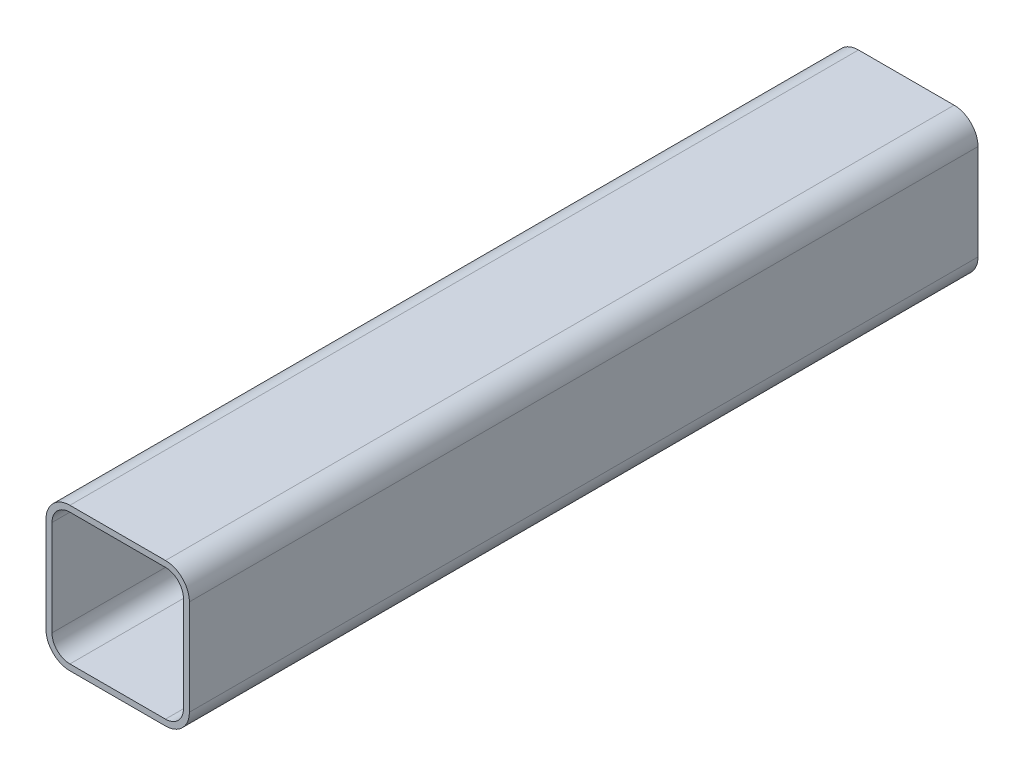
ISO-10303-21;
HEADER;
FILE_DESCRIPTION(('STEP AP214'),'2;1');
FILE_NAME('part.step','',(''),(''),'','','');
FILE_SCHEMA(('AUTOMOTIVE_DESIGN { 1 0 10303 214 1 1 1 1 }'));
ENDSEC;
DATA;
#1=APPLICATION_CONTEXT('core data for automotive mechanical design processes');
#2=APPLICATION_PROTOCOL_DEFINITION('international standard','automotive_design',2000,#1);
#3=PRODUCT_CONTEXT('',#1,'mechanical');
#4=PRODUCT('Part','Part','',(#3));
#5=PRODUCT_RELATED_PRODUCT_CATEGORY('part','',(#4));
#6=PRODUCT_DEFINITION_FORMATION('','',#4);
#7=PRODUCT_DEFINITION_CONTEXT('part definition',#1,'design');
#8=PRODUCT_DEFINITION('design','',#6,#7);
#9=PRODUCT_DEFINITION_SHAPE('','',#8);
#10=(LENGTH_UNIT() NAMED_UNIT(*) SI_UNIT(.MILLI.,.METRE.));
#11=(NAMED_UNIT(*) PLANE_ANGLE_UNIT() SI_UNIT($,.RADIAN.));
#12=(NAMED_UNIT(*) SI_UNIT($,.STERADIAN.) SOLID_ANGLE_UNIT());
#13=UNCERTAINTY_MEASURE_WITH_UNIT(LENGTH_MEASURE(1.E-05),#10,'distance_accuracy_value','');
#14=(GEOMETRIC_REPRESENTATION_CONTEXT(3) GLOBAL_UNCERTAINTY_ASSIGNED_CONTEXT((#13)) GLOBAL_UNIT_ASSIGNED_CONTEXT((#10,
#11,#12)) REPRESENTATION_CONTEXT('',''));
#15=CARTESIAN_POINT('',(0.,0.,0.));
#16=DIRECTION('',(0.,0.,1.));
#17=DIRECTION('',(1.,0.,0.));
#18=AXIS2_PLACEMENT_3D('',#15,#16,#17);
#19=CARTESIAN_POINT('',(25.4,25.4,419.1));
#20=DIRECTION('',(0.,0.,1.));
#21=DIRECTION('',(1.,0.,0.));
#22=AXIS2_PLACEMENT_3D('',#19,#20,#21);
#23=PLANE('',#22);
#24=CARTESIAN_POINT('',(25.4,25.4,419.1));
#25=DIRECTION('',(0.,0.,1.));
#26=DIRECTION('',(1.,0.,0.));
#27=AXIS2_PLACEMENT_3D('',#24,#25,#26);
#28=CIRCLE('',#27,12.7);
#29=CARTESIAN_POINT('',(38.1,25.4,419.1));
#30=VERTEX_POINT('',#29);
#31=CARTESIAN_POINT('',(25.4,38.1,419.1));
#32=VERTEX_POINT('',#31);
#33=EDGE_CURVE('E212',#30,#32,#28,.T.);
#34=ORIENTED_EDGE('',*,*,#33,.T.);
#35=DIRECTION('',(1.,0.,0.));
#36=VECTOR('',#35,1.);
#37=CARTESIAN_POINT('',(-25.4,38.1,419.1));
#38=LINE('',#37,#36);
#39=CARTESIAN_POINT('',(-25.4,38.1,419.1));
#40=VERTEX_POINT('',#39);
#41=EDGE_CURVE('E214',#40,#32,#38,.T.);
#42=ORIENTED_EDGE('',*,*,#41,.F.);
#43=CARTESIAN_POINT('',(-25.4,25.4,419.1));
#44=DIRECTION('',(0.,0.,-1.));
#45=DIRECTION('',(-1.,0.,0.));
#46=AXIS2_PLACEMENT_3D('',#43,#44,#45);
#47=CIRCLE('',#46,12.7);
#48=CARTESIAN_POINT('',(-38.1,25.4,419.1));
#49=VERTEX_POINT('',#48);
#50=EDGE_CURVE('E218',#49,#40,#47,.T.);
#51=ORIENTED_EDGE('',*,*,#50,.F.);
#52=DIRECTION('',(0.,-1.,0.));
#53=VECTOR('',#52,1.);
#54=CARTESIAN_POINT('',(-38.1,25.4,419.1));
#55=LINE('',#54,#53);
#56=CARTESIAN_POINT('',(-38.1,-25.4,419.1));
#57=VERTEX_POINT('',#56);
#58=EDGE_CURVE('E221',#49,#57,#55,.T.);
#59=ORIENTED_EDGE('',*,*,#58,.T.);
#60=CARTESIAN_POINT('',(-25.4,-25.4,419.1));
#61=DIRECTION('',(0.,0.,-1.));
#62=DIRECTION('',(-1.,0.,0.));
#63=AXIS2_PLACEMENT_3D('',#60,#61,#62);
#64=CIRCLE('',#63,12.7);
#65=CARTESIAN_POINT('',(-25.4,-38.1,419.1));
#66=VERTEX_POINT('',#65);
#67=EDGE_CURVE('E223',#66,#57,#64,.T.);
#68=ORIENTED_EDGE('',*,*,#67,.F.);
#69=DIRECTION('',(-1.,0.,0.));
#70=VECTOR('',#69,1.);
#71=CARTESIAN_POINT('',(25.4,-38.1,419.1));
#72=LINE('',#71,#70);
#73=CARTESIAN_POINT('',(25.4,-38.1,419.1));
#74=VERTEX_POINT('',#73);
#75=EDGE_CURVE('E226',#74,#66,#72,.T.);
#76=ORIENTED_EDGE('',*,*,#75,.F.);
#77=CARTESIAN_POINT('',(25.4,-25.4,419.1));
#78=DIRECTION('',(0.,0.,-1.));
#79=DIRECTION('',(-1.,0.,0.));
#80=AXIS2_PLACEMENT_3D('',#77,#78,#79);
#81=CIRCLE('',#80,12.7);
#82=CARTESIAN_POINT('',(38.1,-25.4000000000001,419.1));
#83=VERTEX_POINT('',#82);
#84=EDGE_CURVE('E229',#83,#74,#81,.T.);
#85=ORIENTED_EDGE('',*,*,#84,.F.);
#86=DIRECTION('',(0.,1.,0.));
#87=VECTOR('',#86,1.);
#88=CARTESIAN_POINT('',(38.1,-25.4000000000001,419.1));
#89=LINE('',#88,#87);
#90=EDGE_CURVE('E232',#83,#30,#89,.T.);
#91=ORIENTED_EDGE('',*,*,#90,.T.);
#92=EDGE_LOOP('',(#34,#42,#51,#59,#68,#76,#85,#91));
#93=FACE_BOUND('',#92,.T.);
#94=DIRECTION('',(1.,0.,0.));
#95=VECTOR('',#94,1.);
#96=CARTESIAN_POINT('',(-25.4,34.925,419.1));
#97=LINE('',#96,#95);
#98=CARTESIAN_POINT('',(-25.4,34.925,419.1));
#99=VERTEX_POINT('',#98);
#100=CARTESIAN_POINT('',(25.4,34.925,419.1));
#101=VERTEX_POINT('',#100);
#102=EDGE_CURVE('E152',#99,#101,#97,.T.);
#103=ORIENTED_EDGE('',*,*,#102,.T.);
#104=CARTESIAN_POINT('',(25.4,25.4,419.1));
#105=DIRECTION('',(0.,0.,1.));
#106=DIRECTION('',(1.,0.,0.));
#107=AXIS2_PLACEMENT_3D('',#104,#105,#106);
#108=CIRCLE('',#107,9.525);
#109=CARTESIAN_POINT('',(34.925,25.4,419.1));
#110=VERTEX_POINT('',#109);
#111=EDGE_CURVE('E143',#110,#101,#108,.T.);
#112=ORIENTED_EDGE('',*,*,#111,.F.);
#113=DIRECTION('',(0.,1.,0.));
#114=VECTOR('',#113,1.);
#115=CARTESIAN_POINT('',(34.925,-25.4000000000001,419.1));
#116=LINE('',#115,#114);
#117=CARTESIAN_POINT('',(34.925,-25.4000000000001,419.1));
#118=VERTEX_POINT('',#117);
#119=EDGE_CURVE('E179',#118,#110,#116,.T.);
#120=ORIENTED_EDGE('',*,*,#119,.F.);
#121=CARTESIAN_POINT('',(25.4,-25.4,419.1));
#122=DIRECTION('',(0.,0.,1.));
#123=DIRECTION('',(1.,0.,0.));
#124=AXIS2_PLACEMENT_3D('',#121,#122,#123);
#125=CIRCLE('',#124,9.525);
#126=CARTESIAN_POINT('',(25.4,-34.925,419.1));
#127=VERTEX_POINT('',#126);
#128=EDGE_CURVE('E47',#118,#127,#125,.F.);
#129=ORIENTED_EDGE('',*,*,#128,.T.);
#130=DIRECTION('',(-1.,0.,0.));
#131=VECTOR('',#130,1.);
#132=CARTESIAN_POINT('',(25.4,-34.925,419.1));
#133=LINE('',#132,#131);
#134=CARTESIAN_POINT('',(-25.4,-34.925,419.1));
#135=VERTEX_POINT('',#134);
#136=EDGE_CURVE('E175',#127,#135,#133,.T.);
#137=ORIENTED_EDGE('',*,*,#136,.T.);
#138=CARTESIAN_POINT('',(-25.4,-25.4,419.1));
#139=DIRECTION('',(0.,0.,1.));
#140=DIRECTION('',(1.,0.,0.));
#141=AXIS2_PLACEMENT_3D('',#138,#139,#140);
#142=CIRCLE('',#141,9.52499999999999);
#143=CARTESIAN_POINT('',(-34.925,-25.4,419.1));
#144=VERTEX_POINT('',#143);
#145=EDGE_CURVE('E172',#135,#144,#142,.F.);
#146=ORIENTED_EDGE('',*,*,#145,.T.);
#147=DIRECTION('',(0.,-1.,0.));
#148=VECTOR('',#147,1.);
#149=CARTESIAN_POINT('',(-34.925,25.4,419.1));
#150=LINE('',#149,#148);
#151=CARTESIAN_POINT('',(-34.925,25.4,419.1));
#152=VERTEX_POINT('',#151);
#153=EDGE_CURVE('E168',#152,#144,#150,.T.);
#154=ORIENTED_EDGE('',*,*,#153,.F.);
#155=CARTESIAN_POINT('',(-25.4,25.4,419.1));
#156=DIRECTION('',(0.,0.,1.));
#157=DIRECTION('',(1.,0.,0.));
#158=AXIS2_PLACEMENT_3D('',#155,#156,#157);
#159=CIRCLE('',#158,9.525);
#160=EDGE_CURVE('E166',#152,#99,#159,.F.);
#161=ORIENTED_EDGE('',*,*,#160,.T.);
#162=EDGE_LOOP('',(#103,#112,#120,#129,#137,#146,#154,#161));
#163=FACE_BOUND('',#162,.T.);
#164=ADVANCED_FACE('F32',(#93,#163),#23,.T.);
#165=CARTESIAN_POINT('',(25.4,25.4,0.));
#166=DIRECTION('',(0.,0.,1.));
#167=DIRECTION('',(1.,0.,0.));
#168=AXIS2_PLACEMENT_3D('',#165,#166,#167);
#169=PLANE('',#168);
#170=CARTESIAN_POINT('',(25.4,25.4,0.));
#171=DIRECTION('',(0.,0.,1.));
#172=DIRECTION('',(1.,0.,0.));
#173=AXIS2_PLACEMENT_3D('',#170,#171,#172);
#174=CIRCLE('',#173,12.7);
#175=CARTESIAN_POINT('',(38.1,25.4,0.));
#176=VERTEX_POINT('',#175);
#177=CARTESIAN_POINT('',(25.4,38.1,0.));
#178=VERTEX_POINT('',#177);
#179=EDGE_CURVE('E161',#176,#178,#174,.T.);
#180=ORIENTED_EDGE('',*,*,#179,.F.);
#181=DIRECTION('',(0.,1.,0.));
#182=VECTOR('',#181,1.);
#183=CARTESIAN_POINT('',(38.1,-25.4000000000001,0.));
#184=LINE('',#183,#182);
#185=CARTESIAN_POINT('',(38.1,-25.4000000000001,0.));
#186=VERTEX_POINT('',#185);
#187=EDGE_CURVE('E215',#186,#176,#184,.T.);
#188=ORIENTED_EDGE('',*,*,#187,.F.);
#189=CARTESIAN_POINT('',(25.4,-25.4,0.));
#190=DIRECTION('',(0.,0.,-1.));
#191=DIRECTION('',(-1.,0.,0.));
#192=AXIS2_PLACEMENT_3D('',#189,#190,#191);
#193=CIRCLE('',#192,12.7);
#194=CARTESIAN_POINT('',(25.4,-38.1,0.));
#195=VERTEX_POINT('',#194);
#196=EDGE_CURVE('E252',#186,#195,#193,.T.);
#197=ORIENTED_EDGE('',*,*,#196,.T.);
#198=DIRECTION('',(-1.,0.,0.));
#199=VECTOR('',#198,1.);
#200=CARTESIAN_POINT('',(25.4,-38.1,0.));
#201=LINE('',#200,#199);
#202=CARTESIAN_POINT('',(-25.4,-38.1,0.));
#203=VERTEX_POINT('',#202);
#204=EDGE_CURVE('E249',#195,#203,#201,.T.);
#205=ORIENTED_EDGE('',*,*,#204,.T.);
#206=CARTESIAN_POINT('',(-25.4,-25.4,0.));
#207=DIRECTION('',(0.,0.,-1.));
#208=DIRECTION('',(-1.,0.,0.));
#209=AXIS2_PLACEMENT_3D('',#206,#207,#208);
#210=CIRCLE('',#209,12.7);
#211=CARTESIAN_POINT('',(-38.1,-25.4,0.));
#212=VERTEX_POINT('',#211);
#213=EDGE_CURVE('E246',#203,#212,#210,.T.);
#214=ORIENTED_EDGE('',*,*,#213,.T.);
#215=DIRECTION('',(0.,-1.,0.));
#216=VECTOR('',#215,1.);
#217=CARTESIAN_POINT('',(-38.1,25.4,0.));
#218=LINE('',#217,#216);
#219=CARTESIAN_POINT('',(-38.1,25.4,0.));
#220=VERTEX_POINT('',#219);
#221=EDGE_CURVE('E243',#220,#212,#218,.T.);
#222=ORIENTED_EDGE('',*,*,#221,.F.);
#223=CARTESIAN_POINT('',(-25.4,25.4,0.));
#224=DIRECTION('',(0.,0.,-1.));
#225=DIRECTION('',(-1.,0.,0.));
#226=AXIS2_PLACEMENT_3D('',#223,#224,#225);
#227=CIRCLE('',#226,12.7);
#228=CARTESIAN_POINT('',(-25.4,38.1,0.));
#229=VERTEX_POINT('',#228);
#230=EDGE_CURVE('E240',#220,#229,#227,.T.);
#231=ORIENTED_EDGE('',*,*,#230,.T.);
#232=DIRECTION('',(1.,0.,0.));
#233=VECTOR('',#232,1.);
#234=CARTESIAN_POINT('',(-25.4,38.1,0.));
#235=LINE('',#234,#233);
#236=EDGE_CURVE('E237',#229,#178,#235,.T.);
#237=ORIENTED_EDGE('',*,*,#236,.T.);
#238=EDGE_LOOP('',(#180,#188,#197,#205,#214,#222,#231,#237));
#239=FACE_BOUND('',#238,.T.);
#240=CARTESIAN_POINT('',(25.4,25.4,0.));
#241=DIRECTION('',(0.,0.,1.));
#242=DIRECTION('',(1.,0.,0.));
#243=AXIS2_PLACEMENT_3D('',#240,#241,#242);
#244=CIRCLE('',#243,9.525);
#245=CARTESIAN_POINT('',(34.925,25.4,0.));
#246=VERTEX_POINT('',#245);
#247=CARTESIAN_POINT('',(25.4,34.925,0.));
#248=VERTEX_POINT('',#247);
#249=EDGE_CURVE('E55',#246,#248,#244,.T.);
#250=ORIENTED_EDGE('',*,*,#249,.T.);
#251=DIRECTION('',(1.,0.,0.));
#252=VECTOR('',#251,1.);
#253=CARTESIAN_POINT('',(-25.4,34.925,0.));
#254=LINE('',#253,#252);
#255=CARTESIAN_POINT('',(-25.4,34.925,0.));
#256=VERTEX_POINT('',#255);
#257=EDGE_CURVE('E160',#256,#248,#254,.T.);
#258=ORIENTED_EDGE('',*,*,#257,.F.);
#259=CARTESIAN_POINT('',(-25.4,25.4,0.));
#260=DIRECTION('',(0.,0.,1.));
#261=DIRECTION('',(1.,0.,0.));
#262=AXIS2_PLACEMENT_3D('',#259,#260,#261);
#263=CIRCLE('',#262,9.525);
#264=CARTESIAN_POINT('',(-34.925,25.4,0.));
#265=VERTEX_POINT('',#264);
#266=EDGE_CURVE('E183',#265,#256,#263,.F.);
#267=ORIENTED_EDGE('',*,*,#266,.F.);
#268=DIRECTION('',(0.,-1.,0.));
#269=VECTOR('',#268,1.);
#270=CARTESIAN_POINT('',(-34.925,25.4,0.));
#271=LINE('',#270,#269);
#272=CARTESIAN_POINT('',(-34.925,-25.4,0.));
#273=VERTEX_POINT('',#272);
#274=EDGE_CURVE('E186',#265,#273,#271,.T.);
#275=ORIENTED_EDGE('',*,*,#274,.T.);
#276=CARTESIAN_POINT('',(-25.4,-25.4,0.));
#277=DIRECTION('',(0.,0.,1.));
#278=DIRECTION('',(1.,0.,0.));
#279=AXIS2_PLACEMENT_3D('',#276,#277,#278);
#280=CIRCLE('',#279,9.52499999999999);
#281=CARTESIAN_POINT('',(-25.4,-34.925,0.));
#282=VERTEX_POINT('',#281);
#283=EDGE_CURVE('E189',#282,#273,#280,.F.);
#284=ORIENTED_EDGE('',*,*,#283,.F.);
#285=DIRECTION('',(-1.,0.,0.));
#286=VECTOR('',#285,1.);
#287=CARTESIAN_POINT('',(25.4,-34.925,0.));
#288=LINE('',#287,#286);
#289=CARTESIAN_POINT('',(25.4,-34.925,0.));
#290=VERTEX_POINT('',#289);
#291=EDGE_CURVE('E192',#290,#282,#288,.T.);
#292=ORIENTED_EDGE('',*,*,#291,.F.);
#293=CARTESIAN_POINT('',(25.4,-25.4,0.));
#294=DIRECTION('',(0.,0.,1.));
#295=DIRECTION('',(1.,0.,0.));
#296=AXIS2_PLACEMENT_3D('',#293,#294,#295);
#297=CIRCLE('',#296,9.525);
#298=CARTESIAN_POINT('',(34.925,-25.4000000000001,0.));
#299=VERTEX_POINT('',#298);
#300=EDGE_CURVE('E195',#299,#290,#297,.F.);
#301=ORIENTED_EDGE('',*,*,#300,.F.);
#302=DIRECTION('',(0.,1.,0.));
#303=VECTOR('',#302,1.);
#304=CARTESIAN_POINT('',(34.925,-25.4000000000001,0.));
#305=LINE('',#304,#303);
#306=EDGE_CURVE('E153',#299,#246,#305,.T.);
#307=ORIENTED_EDGE('',*,*,#306,.T.);
#308=EDGE_LOOP('',(#250,#258,#267,#275,#284,#292,#301,#307));
#309=FACE_BOUND('',#308,.T.);
#310=ADVANCED_FACE('F279',(#239,#309),#169,.F.);
#311=CARTESIAN_POINT('',(25.4,25.4,419.1));
#312=DIRECTION('',(0.,0.,-1.));
#313=DIRECTION('',(-1.,0.,0.));
#314=AXIS2_PLACEMENT_3D('',#311,#312,#313);
#315=CYLINDRICAL_SURFACE('',#314,12.7);
#316=ORIENTED_EDGE('',*,*,#179,.T.);
#317=DIRECTION('',(0.,0.,-1.));
#318=VECTOR('',#317,1.);
#319=CARTESIAN_POINT('',(25.4,38.1,419.1));
#320=LINE('',#319,#318);
#321=EDGE_CURVE('E11',#32,#178,#320,.T.);
#322=ORIENTED_EDGE('',*,*,#321,.F.);
#323=ORIENTED_EDGE('',*,*,#33,.F.);
#324=DIRECTION('',(0.,0.,-1.));
#325=VECTOR('',#324,1.);
#326=CARTESIAN_POINT('',(38.1,25.4,419.1));
#327=LINE('',#326,#325);
#328=EDGE_CURVE('E234',#30,#176,#327,.T.);
#329=ORIENTED_EDGE('',*,*,#328,.T.);
#330=EDGE_LOOP('',(#316,#322,#323,#329));
#331=FACE_BOUND('',#330,.T.);
#332=ADVANCED_FACE('F34',(#331),#315,.T.);
#333=CARTESIAN_POINT('',(-25.4,38.1,419.1));
#334=DIRECTION('',(0.,1.,0.));
#335=DIRECTION('',(-1.,0.,0.));
#336=AXIS2_PLACEMENT_3D('',#333,#334,#335);
#337=PLANE('',#336);
#338=ORIENTED_EDGE('',*,*,#236,.F.);
#339=DIRECTION('',(0.,0.,-1.));
#340=VECTOR('',#339,1.);
#341=CARTESIAN_POINT('',(-25.4,38.1,419.1));
#342=LINE('',#341,#340);
#343=EDGE_CURVE('E40',#40,#229,#342,.T.);
#344=ORIENTED_EDGE('',*,*,#343,.F.);
#345=ORIENTED_EDGE('',*,*,#41,.T.);
#346=ORIENTED_EDGE('',*,*,#321,.T.);
#347=EDGE_LOOP('',(#338,#344,#345,#346));
#348=FACE_BOUND('',#347,.T.);
#349=ADVANCED_FACE('F274',(#348),#337,.T.);
#350=CARTESIAN_POINT('',(-25.4,25.4,419.1));
#351=DIRECTION('',(0.,0.,-1.));
#352=DIRECTION('',(-1.,0.,0.));
#353=AXIS2_PLACEMENT_3D('',#350,#351,#352);
#354=CYLINDRICAL_SURFACE('',#353,12.7);
#355=ORIENTED_EDGE('',*,*,#230,.F.);
#356=DIRECTION('',(0.,0.,-1.));
#357=VECTOR('',#356,1.);
#358=CARTESIAN_POINT('',(-38.1,25.4,419.1));
#359=LINE('',#358,#357);
#360=EDGE_CURVE('E266',#49,#220,#359,.T.);
#361=ORIENTED_EDGE('',*,*,#360,.F.);
#362=ORIENTED_EDGE('',*,*,#50,.T.);
#363=ORIENTED_EDGE('',*,*,#343,.T.);
#364=EDGE_LOOP('',(#355,#361,#362,#363));
#365=FACE_BOUND('',#364,.T.);
#366=ADVANCED_FACE('F270',(#365),#354,.T.);
#367=CARTESIAN_POINT('',(-38.1,25.4,419.1));
#368=DIRECTION('',(1.,0.,0.));
#369=DIRECTION('',(0.,1.,0.));
#370=AXIS2_PLACEMENT_3D('',#367,#368,#369);
#371=PLANE('',#370);
#372=ORIENTED_EDGE('',*,*,#221,.T.);
#373=DIRECTION('',(0.,0.,-1.));
#374=VECTOR('',#373,1.);
#375=CARTESIAN_POINT('',(-38.1,-25.4,419.1));
#376=LINE('',#375,#374);
#377=EDGE_CURVE('E264',#57,#212,#376,.T.);
#378=ORIENTED_EDGE('',*,*,#377,.F.);
#379=ORIENTED_EDGE('',*,*,#58,.F.);
#380=ORIENTED_EDGE('',*,*,#360,.T.);
#381=EDGE_LOOP('',(#372,#378,#379,#380));
#382=FACE_BOUND('',#381,.T.);
#383=ADVANCED_FACE('F284',(#382),#371,.F.);
#384=CARTESIAN_POINT('',(-25.4,-25.4,419.1));
#385=DIRECTION('',(0.,0.,-1.));
#386=DIRECTION('',(-1.,0.,0.));
#387=AXIS2_PLACEMENT_3D('',#384,#385,#386);
#388=CYLINDRICAL_SURFACE('',#387,12.7);
#389=ORIENTED_EDGE('',*,*,#213,.F.);
#390=DIRECTION('',(0.,0.,-1.));
#391=VECTOR('',#390,1.);
#392=CARTESIAN_POINT('',(-25.4,-38.1,419.1));
#393=LINE('',#392,#391);
#394=EDGE_CURVE('E262',#66,#203,#393,.T.);
#395=ORIENTED_EDGE('',*,*,#394,.F.);
#396=ORIENTED_EDGE('',*,*,#67,.T.);
#397=ORIENTED_EDGE('',*,*,#377,.T.);
#398=EDGE_LOOP('',(#389,#395,#396,#397));
#399=FACE_BOUND('',#398,.T.);
#400=ADVANCED_FACE('F303',(#399),#388,.T.);
#401=CARTESIAN_POINT('',(25.4,-38.1,419.1));
#402=DIRECTION('',(0.,-1.,0.));
#403=DIRECTION('',(1.,0.,0.));
#404=AXIS2_PLACEMENT_3D('',#401,#402,#403);
#405=PLANE('',#404);
#406=ORIENTED_EDGE('',*,*,#204,.F.);
#407=DIRECTION('',(0.,0.,-1.));
#408=VECTOR('',#407,1.);
#409=CARTESIAN_POINT('',(25.4,-38.1,419.1));
#410=LINE('',#409,#408);
#411=EDGE_CURVE('E260',#74,#195,#410,.T.);
#412=ORIENTED_EDGE('',*,*,#411,.F.);
#413=ORIENTED_EDGE('',*,*,#75,.T.);
#414=ORIENTED_EDGE('',*,*,#394,.T.);
#415=EDGE_LOOP('',(#406,#412,#413,#414));
#416=FACE_BOUND('',#415,.T.);
#417=ADVANCED_FACE('F301',(#416),#405,.T.);
#418=CARTESIAN_POINT('',(25.4,-25.4,419.1));
#419=DIRECTION('',(0.,0.,-1.));
#420=DIRECTION('',(-1.,0.,0.));
#421=AXIS2_PLACEMENT_3D('',#418,#419,#420);
#422=CYLINDRICAL_SURFACE('',#421,12.7);
#423=ORIENTED_EDGE('',*,*,#196,.F.);
#424=DIRECTION('',(0.,0.,-1.));
#425=VECTOR('',#424,1.);
#426=CARTESIAN_POINT('',(38.1,-25.4000000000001,419.1));
#427=LINE('',#426,#425);
#428=EDGE_CURVE('E258',#83,#186,#427,.T.);
#429=ORIENTED_EDGE('',*,*,#428,.F.);
#430=ORIENTED_EDGE('',*,*,#84,.T.);
#431=ORIENTED_EDGE('',*,*,#411,.T.);
#432=EDGE_LOOP('',(#423,#429,#430,#431));
#433=FACE_BOUND('',#432,.T.);
#434=ADVANCED_FACE('F297',(#433),#422,.T.);
#435=CARTESIAN_POINT('',(38.1,-25.4000000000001,419.1));
#436=DIRECTION('',(-1.,0.,0.));
#437=DIRECTION('',(0.,-1.,0.));
#438=AXIS2_PLACEMENT_3D('',#435,#436,#437);
#439=PLANE('',#438);
#440=ORIENTED_EDGE('',*,*,#187,.T.);
#441=ORIENTED_EDGE('',*,*,#328,.F.);
#442=ORIENTED_EDGE('',*,*,#90,.F.);
#443=ORIENTED_EDGE('',*,*,#428,.T.);
#444=EDGE_LOOP('',(#440,#441,#442,#443));
#445=FACE_BOUND('',#444,.T.);
#446=ADVANCED_FACE('F321',(#445),#439,.F.);
#447=CARTESIAN_POINT('',(25.4,25.4,419.1));
#448=DIRECTION('',(0.,0.,-1.));
#449=DIRECTION('',(-1.,0.,0.));
#450=AXIS2_PLACEMENT_3D('',#447,#448,#449);
#451=CYLINDRICAL_SURFACE('',#450,9.525);
#452=ORIENTED_EDGE('',*,*,#249,.F.);
#453=DIRECTION('',(0.,0.,-1.));
#454=VECTOR('',#453,1.);
#455=CARTESIAN_POINT('',(34.925,25.4,419.1));
#456=LINE('',#455,#454);
#457=EDGE_CURVE('E148',#110,#246,#456,.T.);
#458=ORIENTED_EDGE('',*,*,#457,.F.);
#459=ORIENTED_EDGE('',*,*,#111,.T.);
#460=DIRECTION('',(0.,0.,-1.));
#461=VECTOR('',#460,1.);
#462=CARTESIAN_POINT('',(25.4,34.925,419.1));
#463=LINE('',#462,#461);
#464=EDGE_CURVE('E146',#101,#248,#463,.T.);
#465=ORIENTED_EDGE('',*,*,#464,.T.);
#466=EDGE_LOOP('',(#452,#458,#459,#465));
#467=FACE_BOUND('',#466,.T.);
#468=ADVANCED_FACE('F145',(#467),#451,.F.);
#469=CARTESIAN_POINT('',(-25.4,34.925,419.1));
#470=DIRECTION('',(0.,1.,0.));
#471=DIRECTION('',(-1.,0.,0.));
#472=AXIS2_PLACEMENT_3D('',#469,#470,#471);
#473=PLANE('',#472);
#474=ORIENTED_EDGE('',*,*,#257,.T.);
#475=ORIENTED_EDGE('',*,*,#464,.F.);
#476=ORIENTED_EDGE('',*,*,#102,.F.);
#477=DIRECTION('',(0.,0.,-1.));
#478=VECTOR('',#477,1.);
#479=CARTESIAN_POINT('',(-25.4,34.925,419.1));
#480=LINE('',#479,#478);
#481=EDGE_CURVE('E162',#99,#256,#480,.T.);
#482=ORIENTED_EDGE('',*,*,#481,.T.);
#483=EDGE_LOOP('',(#474,#475,#476,#482));
#484=FACE_BOUND('',#483,.T.);
#485=ADVANCED_FACE('F157',(#484),#473,.F.);
#486=CARTESIAN_POINT('',(-25.4,25.4,419.1));
#487=DIRECTION('',(0.,0.,-1.));
#488=DIRECTION('',(-1.,0.,0.));
#489=AXIS2_PLACEMENT_3D('',#486,#487,#488);
#490=CYLINDRICAL_SURFACE('',#489,9.525);
#491=ORIENTED_EDGE('',*,*,#266,.T.);
#492=ORIENTED_EDGE('',*,*,#481,.F.);
#493=ORIENTED_EDGE('',*,*,#160,.F.);
#494=DIRECTION('',(0.,0.,-1.));
#495=VECTOR('',#494,1.);
#496=CARTESIAN_POINT('',(-34.925,25.4,419.1));
#497=LINE('',#496,#495);
#498=EDGE_CURVE('E209',#152,#265,#497,.T.);
#499=ORIENTED_EDGE('',*,*,#498,.T.);
#500=EDGE_LOOP('',(#491,#492,#493,#499));
#501=FACE_BOUND('',#500,.T.);
#502=ADVANCED_FACE('F344',(#501),#490,.F.);
#503=CARTESIAN_POINT('',(-34.925,25.4,419.1));
#504=DIRECTION('',(1.,0.,0.));
#505=DIRECTION('',(0.,1.,0.));
#506=AXIS2_PLACEMENT_3D('',#503,#504,#505);
#507=PLANE('',#506);
#508=ORIENTED_EDGE('',*,*,#274,.F.);
#509=ORIENTED_EDGE('',*,*,#498,.F.);
#510=ORIENTED_EDGE('',*,*,#153,.T.);
#511=DIRECTION('',(0.,0.,-1.));
#512=VECTOR('',#511,1.);
#513=CARTESIAN_POINT('',(-34.925,-25.4,419.1));
#514=LINE('',#513,#512);
#515=EDGE_CURVE('E207',#144,#273,#514,.T.);
#516=ORIENTED_EDGE('',*,*,#515,.T.);
#517=EDGE_LOOP('',(#508,#509,#510,#516));
#518=FACE_BOUND('',#517,.T.);
#519=ADVANCED_FACE('F350',(#518),#507,.T.);
#520=CARTESIAN_POINT('',(-25.4,-25.4,419.1));
#521=DIRECTION('',(0.,0.,-1.));
#522=DIRECTION('',(-1.,0.,0.));
#523=AXIS2_PLACEMENT_3D('',#520,#521,#522);
#524=CYLINDRICAL_SURFACE('',#523,9.52499999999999);
#525=ORIENTED_EDGE('',*,*,#283,.T.);
#526=ORIENTED_EDGE('',*,*,#515,.F.);
#527=ORIENTED_EDGE('',*,*,#145,.F.);
#528=DIRECTION('',(0.,0.,-1.));
#529=VECTOR('',#528,1.);
#530=CARTESIAN_POINT('',(-25.4,-34.925,419.1));
#531=LINE('',#530,#529);
#532=EDGE_CURVE('E205',#135,#282,#531,.T.);
#533=ORIENTED_EDGE('',*,*,#532,.T.);
#534=EDGE_LOOP('',(#525,#526,#527,#533));
#535=FACE_BOUND('',#534,.T.);
#536=ADVANCED_FACE('F358',(#535),#524,.F.);
#537=CARTESIAN_POINT('',(25.4,-34.925,419.1));
#538=DIRECTION('',(0.,-1.,0.));
#539=DIRECTION('',(1.,0.,0.));
#540=AXIS2_PLACEMENT_3D('',#537,#538,#539);
#541=PLANE('',#540);
#542=ORIENTED_EDGE('',*,*,#291,.T.);
#543=ORIENTED_EDGE('',*,*,#532,.F.);
#544=ORIENTED_EDGE('',*,*,#136,.F.);
#545=DIRECTION('',(0.,0.,-1.));
#546=VECTOR('',#545,1.);
#547=CARTESIAN_POINT('',(25.4,-34.925,419.1));
#548=LINE('',#547,#546);
#549=EDGE_CURVE('E203',#127,#290,#548,.T.);
#550=ORIENTED_EDGE('',*,*,#549,.T.);
#551=EDGE_LOOP('',(#542,#543,#544,#550));
#552=FACE_BOUND('',#551,.T.);
#553=ADVANCED_FACE('F366',(#552),#541,.F.);
#554=CARTESIAN_POINT('',(25.4,-25.4,419.1));
#555=DIRECTION('',(0.,0.,-1.));
#556=DIRECTION('',(-1.,0.,0.));
#557=AXIS2_PLACEMENT_3D('',#554,#555,#556);
#558=CYLINDRICAL_SURFACE('',#557,9.525);
#559=ORIENTED_EDGE('',*,*,#300,.T.);
#560=ORIENTED_EDGE('',*,*,#549,.F.);
#561=ORIENTED_EDGE('',*,*,#128,.F.);
#562=DIRECTION('',(0.,0.,-1.));
#563=VECTOR('',#562,1.);
#564=CARTESIAN_POINT('',(34.925,-25.4000000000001,419.1));
#565=LINE('',#564,#563);
#566=EDGE_CURVE('E201',#118,#299,#565,.T.);
#567=ORIENTED_EDGE('',*,*,#566,.T.);
#568=EDGE_LOOP('',(#559,#560,#561,#567));
#569=FACE_BOUND('',#568,.T.);
#570=ADVANCED_FACE('F374',(#569),#558,.F.);
#571=CARTESIAN_POINT('',(34.925,-25.4000000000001,419.1));
#572=DIRECTION('',(-1.,0.,0.));
#573=DIRECTION('',(0.,-1.,0.));
#574=AXIS2_PLACEMENT_3D('',#571,#572,#573);
#575=PLANE('',#574);
#576=ORIENTED_EDGE('',*,*,#306,.F.);
#577=ORIENTED_EDGE('',*,*,#566,.F.);
#578=ORIENTED_EDGE('',*,*,#119,.T.);
#579=ORIENTED_EDGE('',*,*,#457,.T.);
#580=EDGE_LOOP('',(#576,#577,#578,#579));
#581=FACE_BOUND('',#580,.T.);
#582=ADVANCED_FACE('F382',(#581),#575,.T.);
#583=CLOSED_SHELL('',(#164,#310,#332,#349,#366,#383,#400,#417,#434,#446,#468,#485,#502,#519,
#536,#553,#570,#582));
#584=MANIFOLD_SOLID_BREP('B2',#583);
#585=ADVANCED_BREP_SHAPE_REPRESENTATION('',(#18,#584),#14);
#586=SHAPE_DEFINITION_REPRESENTATION(#9,#585);
ENDSEC;
END-ISO-10303-21;
